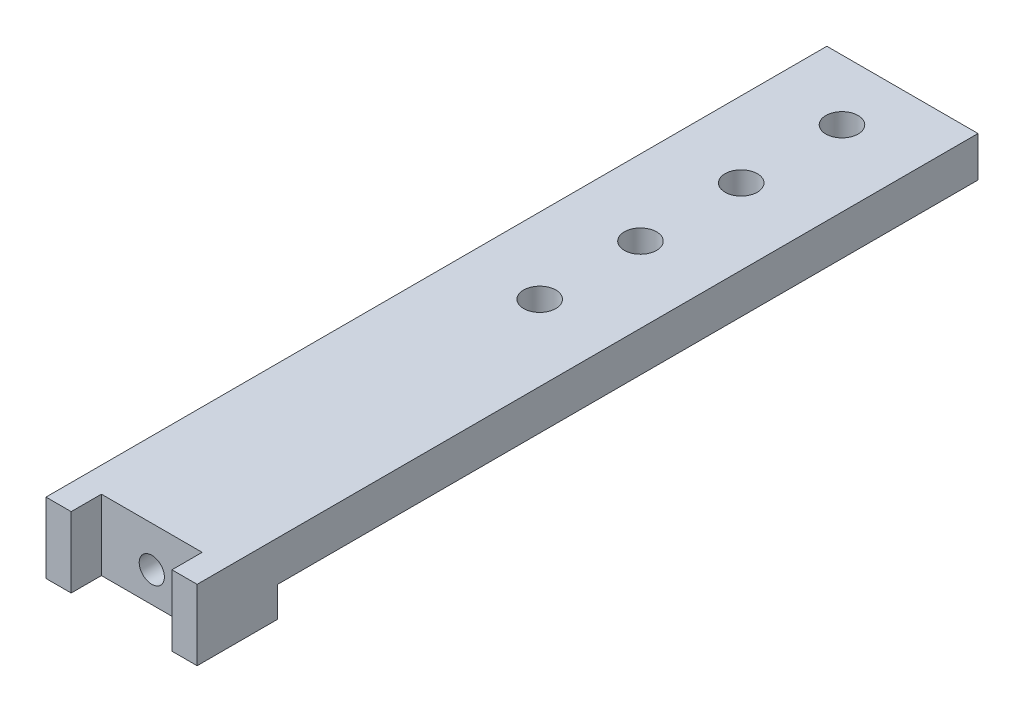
ISO-10303-21;
HEADER;
FILE_DESCRIPTION(('STEP AP214'),'2;1');
FILE_NAME('part.step','',(''),(''),'','','');
FILE_SCHEMA(('AUTOMOTIVE_DESIGN { 1 0 10303 214 1 1 1 1 }'));
ENDSEC;
DATA;
#1=APPLICATION_CONTEXT('core data for automotive mechanical design processes');
#2=APPLICATION_PROTOCOL_DEFINITION('international standard','automotive_design',2000,#1);
#3=PRODUCT_CONTEXT('',#1,'mechanical');
#4=PRODUCT('Part','Part','',(#3));
#5=PRODUCT_RELATED_PRODUCT_CATEGORY('part','',(#4));
#6=PRODUCT_DEFINITION_FORMATION('','',#4);
#7=PRODUCT_DEFINITION_CONTEXT('part definition',#1,'design');
#8=PRODUCT_DEFINITION('design','',#6,#7);
#9=PRODUCT_DEFINITION_SHAPE('','',#8);
#10=(LENGTH_UNIT() NAMED_UNIT(*) SI_UNIT(.MILLI.,.METRE.));
#11=(NAMED_UNIT(*) PLANE_ANGLE_UNIT() SI_UNIT($,.RADIAN.));
#12=(NAMED_UNIT(*) SI_UNIT($,.STERADIAN.) SOLID_ANGLE_UNIT());
#13=UNCERTAINTY_MEASURE_WITH_UNIT(LENGTH_MEASURE(1.E-05),#10,'distance_accuracy_value','');
#14=(GEOMETRIC_REPRESENTATION_CONTEXT(3) GLOBAL_UNCERTAINTY_ASSIGNED_CONTEXT((#13)) GLOBAL_UNIT_ASSIGNED_CONTEXT((#10,
#11,#12)) REPRESENTATION_CONTEXT('',''));
#15=CARTESIAN_POINT('',(0.,0.,0.));
#16=DIRECTION('',(0.,0.,1.));
#17=DIRECTION('',(1.,0.,0.));
#18=AXIS2_PLACEMENT_3D('',#15,#16,#17);
#19=CARTESIAN_POINT('',(-7.49999999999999,4.,37.25));
#20=DIRECTION('',(0.,0.,-1.));
#21=DIRECTION('',(-1.,0.,0.));
#22=AXIS2_PLACEMENT_3D('',#19,#20,#21);
#23=PLANE('',#22);
#24=CARTESIAN_POINT('',(0.,0.,37.25));
#25=DIRECTION('',(0.,0.,1.));
#26=DIRECTION('',(1.,0.,0.));
#27=AXIS2_PLACEMENT_3D('',#24,#25,#26);
#28=CIRCLE('',#27,1.25);
#29=CARTESIAN_POINT('',(1.25,0.,37.25));
#30=VERTEX_POINT('',#29);
#31=EDGE_CURVE('E146',#30,#30,#28,.T.);
#32=ORIENTED_EDGE('',*,*,#31,.F.);
#33=EDGE_LOOP('',(#32));
#34=FACE_BOUND('',#33,.T.);
#35=DIRECTION('',(0.,1.,0.));
#36=VECTOR('',#35,1.);
#37=CARTESIAN_POINT('',(-5.,-3.,37.25));
#38=LINE('',#37,#36);
#39=CARTESIAN_POINT('',(-5.,-3.,37.25));
#40=VERTEX_POINT('',#39);
#41=CARTESIAN_POINT('',(-5.,4.,37.25));
#42=VERTEX_POINT('',#41);
#43=EDGE_CURVE('E528',#40,#42,#38,.T.);
#44=ORIENTED_EDGE('',*,*,#43,.F.);
#45=DIRECTION('',(-1.,0.,0.));
#46=VECTOR('',#45,1.);
#47=CARTESIAN_POINT('',(7.50000000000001,-3.,37.25));
#48=LINE('',#47,#46);
#49=CARTESIAN_POINT('',(5.00000000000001,-3.,37.25));
#50=VERTEX_POINT('',#49);
#51=EDGE_CURVE('E168',#50,#40,#48,.T.);
#52=ORIENTED_EDGE('',*,*,#51,.F.);
#53=DIRECTION('',(0.,-1.,0.));
#54=VECTOR('',#53,1.);
#55=CARTESIAN_POINT('',(5.00000000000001,-3.,37.25));
#56=LINE('',#55,#54);
#57=CARTESIAN_POINT('',(5.00000000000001,4.,37.25));
#58=VERTEX_POINT('',#57);
#59=EDGE_CURVE('E274',#58,#50,#56,.T.);
#60=ORIENTED_EDGE('',*,*,#59,.F.);
#61=DIRECTION('',(1.,0.,0.));
#62=VECTOR('',#61,1.);
#63=CARTESIAN_POINT('',(-7.49999999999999,4.,37.25));
#64=LINE('',#63,#62);
#65=EDGE_CURVE('E56',#42,#58,#64,.T.);
#66=ORIENTED_EDGE('',*,*,#65,.F.);
#67=EDGE_LOOP('',(#44,#52,#60,#66));
#68=FACE_BOUND('',#67,.T.);
#69=ADVANCED_FACE('F34',(#34,#68),#23,.F.);
#70=CARTESIAN_POINT('',(0.,0.,0.));
#71=DIRECTION('',(0.,1.,0.));
#72=DIRECTION('',(0.,0.,1.));
#73=AXIS2_PLACEMENT_3D('',#70,#71,#72);
#74=PLANE('',#73);
#75=DIRECTION('',(1.,0.,0.));
#76=VECTOR('',#75,1.);
#77=CARTESIAN_POINT('',(7.50000000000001,0.,32.25));
#78=LINE('',#77,#76);
#79=CARTESIAN_POINT('',(-7.49999999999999,0.,32.25));
#80=VERTEX_POINT('',#79);
#81=CARTESIAN_POINT('',(-1.25,0.,32.25));
#82=VERTEX_POINT('',#81);
#83=EDGE_CURVE('E157',#80,#82,#78,.T.);
#84=ORIENTED_EDGE('',*,*,#83,.F.);
#85=DIRECTION('',(0.,0.,1.));
#86=VECTOR('',#85,1.);
#87=CARTESIAN_POINT('',(-7.5,0.,-37.25));
#88=LINE('',#87,#86);
#89=CARTESIAN_POINT('',(-7.5,0.,-37.25));
#90=VERTEX_POINT('',#89);
#91=EDGE_CURVE('E231',#90,#80,#88,.T.);
#92=ORIENTED_EDGE('',*,*,#91,.F.);
#93=DIRECTION('',(-1.,0.,0.));
#94=VECTOR('',#93,1.);
#95=CARTESIAN_POINT('',(-7.5,0.,-37.25));
#96=LINE('',#95,#94);
#97=CARTESIAN_POINT('',(-5.,0.,-37.25));
#98=VERTEX_POINT('',#97);
#99=EDGE_CURVE('E237',#98,#90,#96,.T.);
#100=ORIENTED_EDGE('',*,*,#99,.F.);
#101=DIRECTION('',(0.,0.,1.));
#102=VECTOR('',#101,1.);
#103=CARTESIAN_POINT('',(-5.,0.,-37.25));
#104=LINE('',#103,#102);
#105=CARTESIAN_POINT('',(-5.,0.,2.75000000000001));
#106=VERTEX_POINT('',#105);
#107=EDGE_CURVE('E213',#98,#106,#104,.T.);
#108=ORIENTED_EDGE('',*,*,#107,.T.);
#109=DIRECTION('',(1.,0.,0.));
#110=VECTOR('',#109,1.);
#111=CARTESIAN_POINT('',(-5.,0.,2.75000000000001));
#112=LINE('',#111,#110);
#113=CARTESIAN_POINT('',(5.,0.,2.75000000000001));
#114=VERTEX_POINT('',#113);
#115=EDGE_CURVE('E201',#106,#114,#112,.T.);
#116=ORIENTED_EDGE('',*,*,#115,.T.);
#117=DIRECTION('',(0.,0.,-1.));
#118=VECTOR('',#117,1.);
#119=CARTESIAN_POINT('',(5.,0.,-37.25));
#120=LINE('',#119,#118);
#121=CARTESIAN_POINT('',(5.,0.,-37.25));
#122=VERTEX_POINT('',#121);
#123=EDGE_CURVE('E194',#114,#122,#120,.T.);
#124=ORIENTED_EDGE('',*,*,#123,.T.);
#125=CARTESIAN_POINT('',(7.5,0.,-37.25));
#126=VERTEX_POINT('',#125);
#127=EDGE_CURVE('E238',#126,#122,#96,.T.);
#128=ORIENTED_EDGE('',*,*,#127,.F.);
#129=DIRECTION('',(0.,0.,-1.));
#130=VECTOR('',#129,1.);
#131=CARTESIAN_POINT('',(7.5,0.,-37.25));
#132=LINE('',#131,#130);
#133=CARTESIAN_POINT('',(7.50000000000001,0.,32.25));
#134=VERTEX_POINT('',#133);
#135=EDGE_CURVE('E221',#134,#126,#132,.T.);
#136=ORIENTED_EDGE('',*,*,#135,.F.);
#137=CARTESIAN_POINT('',(1.25,0.,32.25));
#138=VERTEX_POINT('',#137);
#139=EDGE_CURVE('E160',#138,#134,#78,.T.);
#140=ORIENTED_EDGE('',*,*,#139,.F.);
#141=EDGE_CURVE('E143',#82,#138,#78,.T.);
#142=ORIENTED_EDGE('',*,*,#141,.F.);
#143=EDGE_LOOP('',(#84,#92,#100,#108,#116,#124,#128,#136,#140,#142));
#144=FACE_BOUND('',#143,.T.);
#145=ADVANCED_FACE('F155',(#144),#74,.F.);
#146=CARTESIAN_POINT('',(7.5,4.,-37.25));
#147=DIRECTION('',(-1.,0.,0.));
#148=DIRECTION('',(0.,0.,1.));
#149=AXIS2_PLACEMENT_3D('',#146,#147,#148);
#150=PLANE('',#149);
#151=DIRECTION('',(0.,0.,-1.));
#152=VECTOR('',#151,1.);
#153=CARTESIAN_POINT('',(7.5,4.,-37.25));
#154=LINE('',#153,#152);
#155=CARTESIAN_POINT('',(7.50000000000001,4.,40.25));
#156=VERTEX_POINT('',#155);
#157=CARTESIAN_POINT('',(7.5,4.,-37.25));
#158=VERTEX_POINT('',#157);
#159=EDGE_CURVE('E227',#156,#158,#154,.T.);
#160=ORIENTED_EDGE('',*,*,#159,.F.);
#161=DIRECTION('',(0.,1.,0.));
#162=VECTOR('',#161,1.);
#163=CARTESIAN_POINT('',(7.50000000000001,-3.,40.25));
#164=LINE('',#163,#162);
#165=CARTESIAN_POINT('',(7.50000000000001,-3.,40.25));
#166=VERTEX_POINT('',#165);
#167=EDGE_CURVE('E265',#166,#156,#164,.T.);
#168=ORIENTED_EDGE('',*,*,#167,.F.);
#169=DIRECTION('',(0.,0.,1.));
#170=VECTOR('',#169,1.);
#171=CARTESIAN_POINT('',(7.50000000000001,-3.,37.25));
#172=LINE('',#171,#170);
#173=CARTESIAN_POINT('',(7.50000000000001,-3.,32.25));
#174=VERTEX_POINT('',#173);
#175=EDGE_CURVE('E167',#174,#166,#172,.T.);
#176=ORIENTED_EDGE('',*,*,#175,.F.);
#177=DIRECTION('',(0.,1.,0.));
#178=VECTOR('',#177,1.);
#179=CARTESIAN_POINT('',(7.50000000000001,-3.,32.25));
#180=LINE('',#179,#178);
#181=EDGE_CURVE('E189',#174,#134,#180,.T.);
#182=ORIENTED_EDGE('',*,*,#181,.T.);
#183=ORIENTED_EDGE('',*,*,#135,.T.);
#184=DIRECTION('',(0.,-1.,0.));
#185=VECTOR('',#184,1.);
#186=CARTESIAN_POINT('',(7.5,4.,-37.25));
#187=LINE('',#186,#185);
#188=EDGE_CURVE('E11',#158,#126,#187,.T.);
#189=ORIENTED_EDGE('',*,*,#188,.F.);
#190=EDGE_LOOP('',(#160,#168,#176,#182,#183,#189));
#191=FACE_BOUND('',#190,.T.);
#192=ADVANCED_FACE('F36',(#191),#150,.F.);
#193=CARTESIAN_POINT('',(-7.5,4.,-37.25));
#194=DIRECTION('',(0.,0.,1.));
#195=DIRECTION('',(1.,0.,0.));
#196=AXIS2_PLACEMENT_3D('',#193,#194,#195);
#197=PLANE('',#196);
#198=ORIENTED_EDGE('',*,*,#127,.T.);
#199=DIRECTION('',(0.,1.,0.));
#200=VECTOR('',#199,1.);
#201=CARTESIAN_POINT('',(5.,-1.,-37.25));
#202=LINE('',#201,#200);
#203=CARTESIAN_POINT('',(5.,-1.,-37.25));
#204=VERTEX_POINT('',#203);
#205=EDGE_CURVE('E210',#204,#122,#202,.T.);
#206=ORIENTED_EDGE('',*,*,#205,.F.);
#207=DIRECTION('',(-1.,0.,0.));
#208=VECTOR('',#207,1.);
#209=CARTESIAN_POINT('',(-5.,-1.,-37.25));
#210=LINE('',#209,#208);
#211=CARTESIAN_POINT('',(-5.,-1.,-37.25));
#212=VERTEX_POINT('',#211);
#213=EDGE_CURVE('E200',#204,#212,#210,.T.);
#214=ORIENTED_EDGE('',*,*,#213,.T.);
#215=DIRECTION('',(0.,1.,0.));
#216=VECTOR('',#215,1.);
#217=CARTESIAN_POINT('',(-5.,-1.,-37.25));
#218=LINE('',#217,#216);
#219=EDGE_CURVE('E224',#212,#98,#218,.T.);
#220=ORIENTED_EDGE('',*,*,#219,.T.);
#221=ORIENTED_EDGE('',*,*,#99,.T.);
#222=DIRECTION('',(0.,-1.,0.));
#223=VECTOR('',#222,1.);
#224=CARTESIAN_POINT('',(-7.5,4.,-37.25));
#225=LINE('',#224,#223);
#226=CARTESIAN_POINT('',(-7.5,4.,-37.25));
#227=VERTEX_POINT('',#226);
#228=EDGE_CURVE('E42',#227,#90,#225,.T.);
#229=ORIENTED_EDGE('',*,*,#228,.F.);
#230=DIRECTION('',(-1.,0.,0.));
#231=VECTOR('',#230,1.);
#232=CARTESIAN_POINT('',(-7.5,4.,-37.25));
#233=LINE('',#232,#231);
#234=EDGE_CURVE('E230',#158,#227,#233,.T.);
#235=ORIENTED_EDGE('',*,*,#234,.F.);
#236=ORIENTED_EDGE('',*,*,#188,.T.);
#237=EDGE_LOOP('',(#198,#206,#214,#220,#221,#229,#235,#236));
#238=FACE_BOUND('',#237,.T.);
#239=ADVANCED_FACE('F250',(#238),#197,.F.);
#240=CARTESIAN_POINT('',(-7.5,4.,-37.25));
#241=DIRECTION('',(1.,0.,0.));
#242=DIRECTION('',(0.,0.,-1.));
#243=AXIS2_PLACEMENT_3D('',#240,#241,#242);
#244=PLANE('',#243);
#245=ORIENTED_EDGE('',*,*,#91,.T.);
#246=DIRECTION('',(0.,1.,0.));
#247=VECTOR('',#246,1.);
#248=CARTESIAN_POINT('',(-7.5,-3.,32.25));
#249=LINE('',#248,#247);
#250=CARTESIAN_POINT('',(-7.5,-3.,32.25));
#251=VERTEX_POINT('',#250);
#252=EDGE_CURVE('E166',#251,#80,#249,.T.);
#253=ORIENTED_EDGE('',*,*,#252,.F.);
#254=DIRECTION('',(0.,0.,-1.));
#255=VECTOR('',#254,1.);
#256=CARTESIAN_POINT('',(-7.49999999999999,-3.,37.25));
#257=LINE('',#256,#255);
#258=CARTESIAN_POINT('',(-7.49999999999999,-3.,40.25));
#259=VERTEX_POINT('',#258);
#260=EDGE_CURVE('E187',#259,#251,#257,.T.);
#261=ORIENTED_EDGE('',*,*,#260,.F.);
#262=DIRECTION('',(0.,-1.,0.));
#263=VECTOR('',#262,1.);
#264=CARTESIAN_POINT('',(-7.49999999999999,-3.,40.25));
#265=LINE('',#264,#263);
#266=CARTESIAN_POINT('',(-7.49999999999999,4.,40.25));
#267=VERTEX_POINT('',#266);
#268=EDGE_CURVE('E534',#267,#259,#265,.T.);
#269=ORIENTED_EDGE('',*,*,#268,.F.);
#270=DIRECTION('',(0.,0.,1.));
#271=VECTOR('',#270,1.);
#272=CARTESIAN_POINT('',(-7.5,4.,-37.25));
#273=LINE('',#272,#271);
#274=EDGE_CURVE('E233',#227,#267,#273,.T.);
#275=ORIENTED_EDGE('',*,*,#274,.F.);
#276=ORIENTED_EDGE('',*,*,#228,.T.);
#277=EDGE_LOOP('',(#245,#253,#261,#269,#275,#276));
#278=FACE_BOUND('',#277,.T.);
#279=ADVANCED_FACE('F245',(#278),#244,.F.);
#280=CARTESIAN_POINT('',(0.,4.,0.));
#281=DIRECTION('',(0.,1.,0.));
#282=DIRECTION('',(0.,0.,1.));
#283=AXIS2_PLACEMENT_3D('',#280,#281,#282);
#284=PLANE('',#283);
#285=CARTESIAN_POINT('',(0.,4.,-21.25));
#286=DIRECTION('',(0.,-1.,0.));
#287=DIRECTION('',(0.,0.,-1.));
#288=AXIS2_PLACEMENT_3D('',#285,#286,#287);
#289=CIRCLE('',#288,1.6);
#290=CARTESIAN_POINT('',(0.,4.,-22.85));
#291=VERTEX_POINT('',#290);
#292=EDGE_CURVE('E525',#291,#291,#289,.T.);
#293=ORIENTED_EDGE('',*,*,#292,.T.);
#294=EDGE_LOOP('',(#293));
#295=FACE_BOUND('',#294,.T.);
#296=CARTESIAN_POINT('',(0.,4.,-11.25));
#297=DIRECTION('',(0.,-1.,0.));
#298=DIRECTION('',(0.,0.,-1.));
#299=AXIS2_PLACEMENT_3D('',#296,#297,#298);
#300=CIRCLE('',#299,1.6);
#301=CARTESIAN_POINT('',(0.,4.,-12.85));
#302=VERTEX_POINT('',#301);
#303=EDGE_CURVE('E556',#302,#302,#300,.T.);
#304=ORIENTED_EDGE('',*,*,#303,.T.);
#305=EDGE_LOOP('',(#304));
#306=FACE_BOUND('',#305,.T.);
#307=CARTESIAN_POINT('',(0.,4.,-1.24999999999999));
#308=DIRECTION('',(0.,-1.,0.));
#309=DIRECTION('',(0.,0.,-1.));
#310=AXIS2_PLACEMENT_3D('',#307,#308,#309);
#311=CIRCLE('',#310,1.6);
#312=CARTESIAN_POINT('',(0.,4.,-2.84999999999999));
#313=VERTEX_POINT('',#312);
#314=EDGE_CURVE('E552',#313,#313,#311,.T.);
#315=ORIENTED_EDGE('',*,*,#314,.T.);
#316=EDGE_LOOP('',(#315));
#317=FACE_BOUND('',#316,.T.);
#318=CARTESIAN_POINT('',(0.,4.,-31.25));
#319=DIRECTION('',(0.,-1.,0.));
#320=DIRECTION('',(0.,0.,-1.));
#321=AXIS2_PLACEMENT_3D('',#318,#319,#320);
#322=CIRCLE('',#321,1.6);
#323=CARTESIAN_POINT('',(0.,4.,-32.85));
#324=VERTEX_POINT('',#323);
#325=EDGE_CURVE('E524',#324,#324,#322,.T.);
#326=ORIENTED_EDGE('',*,*,#325,.T.);
#327=EDGE_LOOP('',(#326));
#328=FACE_BOUND('',#327,.T.);
#329=ORIENTED_EDGE('',*,*,#159,.T.);
#330=ORIENTED_EDGE('',*,*,#234,.T.);
#331=ORIENTED_EDGE('',*,*,#274,.T.);
#332=DIRECTION('',(-1.,0.,0.));
#333=VECTOR('',#332,1.);
#334=CARTESIAN_POINT('',(-7.49999999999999,4.,40.25));
#335=LINE('',#334,#333);
#336=CARTESIAN_POINT('',(-5.,4.,40.25));
#337=VERTEX_POINT('',#336);
#338=EDGE_CURVE('E541',#337,#267,#335,.T.);
#339=ORIENTED_EDGE('',*,*,#338,.F.);
#340=DIRECTION('',(0.,0.,-1.));
#341=VECTOR('',#340,1.);
#342=CARTESIAN_POINT('',(-5.,4.,40.25));
#343=LINE('',#342,#341);
#344=EDGE_CURVE('E544',#337,#42,#343,.T.);
#345=ORIENTED_EDGE('',*,*,#344,.T.);
#346=ORIENTED_EDGE('',*,*,#65,.T.);
#347=DIRECTION('',(0.,0.,-1.));
#348=VECTOR('',#347,1.);
#349=CARTESIAN_POINT('',(5.00000000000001,4.,40.25));
#350=LINE('',#349,#348);
#351=CARTESIAN_POINT('',(5.00000000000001,4.,40.25));
#352=VERTEX_POINT('',#351);
#353=EDGE_CURVE('E172',#352,#58,#350,.T.);
#354=ORIENTED_EDGE('',*,*,#353,.F.);
#355=DIRECTION('',(-1.,0.,0.));
#356=VECTOR('',#355,1.);
#357=CARTESIAN_POINT('',(7.50000000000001,4.,40.25));
#358=LINE('',#357,#356);
#359=EDGE_CURVE('E266',#156,#352,#358,.T.);
#360=ORIENTED_EDGE('',*,*,#359,.F.);
#361=EDGE_LOOP('',(#329,#330,#331,#339,#345,#346,#354,#360));
#362=FACE_BOUND('',#361,.T.);
#363=ADVANCED_FACE('F267',(#295,#306,#317,#328,#362),#284,.T.);
#364=CARTESIAN_POINT('',(5.,-1.,-37.25));
#365=DIRECTION('',(1.,0.,0.));
#366=DIRECTION('',(0.,0.,-1.));
#367=AXIS2_PLACEMENT_3D('',#364,#365,#366);
#368=PLANE('',#367);
#369=ORIENTED_EDGE('',*,*,#123,.F.);
#370=DIRECTION('',(0.,1.,0.));
#371=VECTOR('',#370,1.);
#372=CARTESIAN_POINT('',(5.,-1.,2.75000000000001));
#373=LINE('',#372,#371);
#374=CARTESIAN_POINT('',(5.,-1.,2.75000000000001));
#375=VERTEX_POINT('',#374);
#376=EDGE_CURVE('E218',#375,#114,#373,.T.);
#377=ORIENTED_EDGE('',*,*,#376,.F.);
#378=DIRECTION('',(0.,0.,-1.));
#379=VECTOR('',#378,1.);
#380=CARTESIAN_POINT('',(5.,-1.,-37.25));
#381=LINE('',#380,#379);
#382=EDGE_CURVE('E197',#375,#204,#381,.T.);
#383=ORIENTED_EDGE('',*,*,#382,.T.);
#384=ORIENTED_EDGE('',*,*,#205,.T.);
#385=EDGE_LOOP('',(#369,#377,#383,#384));
#386=FACE_BOUND('',#385,.T.);
#387=ADVANCED_FACE('F443',(#386),#368,.T.);
#388=CARTESIAN_POINT('',(-5.,-1.,2.75000000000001));
#389=DIRECTION('',(0.,0.,1.));
#390=DIRECTION('',(1.,0.,0.));
#391=AXIS2_PLACEMENT_3D('',#388,#389,#390);
#392=PLANE('',#391);
#393=ORIENTED_EDGE('',*,*,#115,.F.);
#394=DIRECTION('',(0.,1.,0.));
#395=VECTOR('',#394,1.);
#396=CARTESIAN_POINT('',(-5.,-1.,2.75000000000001));
#397=LINE('',#396,#395);
#398=CARTESIAN_POINT('',(-5.,-1.,2.75000000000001));
#399=VERTEX_POINT('',#398);
#400=EDGE_CURVE('E222',#399,#106,#397,.T.);
#401=ORIENTED_EDGE('',*,*,#400,.F.);
#402=DIRECTION('',(1.,0.,0.));
#403=VECTOR('',#402,1.);
#404=CARTESIAN_POINT('',(-5.,-1.,2.75000000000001));
#405=LINE('',#404,#403);
#406=EDGE_CURVE('E207',#399,#375,#405,.T.);
#407=ORIENTED_EDGE('',*,*,#406,.T.);
#408=ORIENTED_EDGE('',*,*,#376,.T.);
#409=EDGE_LOOP('',(#393,#401,#407,#408));
#410=FACE_BOUND('',#409,.T.);
#411=ADVANCED_FACE('F258',(#410),#392,.T.);
#412=CARTESIAN_POINT('',(-5.,-1.,-37.25));
#413=DIRECTION('',(-1.,0.,0.));
#414=DIRECTION('',(0.,0.,1.));
#415=AXIS2_PLACEMENT_3D('',#412,#413,#414);
#416=PLANE('',#415);
#417=ORIENTED_EDGE('',*,*,#107,.F.);
#418=ORIENTED_EDGE('',*,*,#219,.F.);
#419=DIRECTION('',(0.,0.,1.));
#420=VECTOR('',#419,1.);
#421=CARTESIAN_POINT('',(-5.,-1.,-37.25));
#422=LINE('',#421,#420);
#423=EDGE_CURVE('E204',#212,#399,#422,.T.);
#424=ORIENTED_EDGE('',*,*,#423,.T.);
#425=ORIENTED_EDGE('',*,*,#400,.T.);
#426=EDGE_LOOP('',(#417,#418,#424,#425));
#427=FACE_BOUND('',#426,.T.);
#428=ADVANCED_FACE('F254',(#427),#416,.T.);
#429=CARTESIAN_POINT('',(0.,-1.,0.));
#430=DIRECTION('',(0.,1.,0.));
#431=DIRECTION('',(0.,0.,1.));
#432=AXIS2_PLACEMENT_3D('',#429,#430,#431);
#433=PLANE('',#432);
#434=CARTESIAN_POINT('',(0.,-1.,-21.25));
#435=DIRECTION('',(0.,-1.,0.));
#436=DIRECTION('',(0.,0.,-1.));
#437=AXIS2_PLACEMENT_3D('',#434,#435,#436);
#438=CIRCLE('',#437,1.6);
#439=CARTESIAN_POINT('',(0.,-1.,-22.85));
#440=VERTEX_POINT('',#439);
#441=EDGE_CURVE('E510',#440,#440,#438,.T.);
#442=ORIENTED_EDGE('',*,*,#441,.F.);
#443=EDGE_LOOP('',(#442));
#444=FACE_BOUND('',#443,.T.);
#445=CARTESIAN_POINT('',(0.,-1.,-11.25));
#446=DIRECTION('',(0.,-1.,0.));
#447=DIRECTION('',(0.,0.,-1.));
#448=AXIS2_PLACEMENT_3D('',#445,#446,#447);
#449=CIRCLE('',#448,1.6);
#450=CARTESIAN_POINT('',(0.,-1.,-12.85));
#451=VERTEX_POINT('',#450);
#452=EDGE_CURVE('E514',#451,#451,#449,.T.);
#453=ORIENTED_EDGE('',*,*,#452,.F.);
#454=EDGE_LOOP('',(#453));
#455=FACE_BOUND('',#454,.T.);
#456=CARTESIAN_POINT('',(0.,-1.,-1.24999999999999));
#457=DIRECTION('',(0.,-1.,0.));
#458=DIRECTION('',(0.,0.,-1.));
#459=AXIS2_PLACEMENT_3D('',#456,#457,#458);
#460=CIRCLE('',#459,1.6);
#461=CARTESIAN_POINT('',(0.,-1.,-2.84999999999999));
#462=VERTEX_POINT('',#461);
#463=EDGE_CURVE('E153',#462,#462,#460,.T.);
#464=ORIENTED_EDGE('',*,*,#463,.F.);
#465=EDGE_LOOP('',(#464));
#466=FACE_BOUND('',#465,.T.);
#467=CARTESIAN_POINT('',(0.,-1.,-31.25));
#468=DIRECTION('',(0.,-1.,0.));
#469=DIRECTION('',(0.,0.,-1.));
#470=AXIS2_PLACEMENT_3D('',#467,#468,#469);
#471=CIRCLE('',#470,1.6);
#472=CARTESIAN_POINT('',(0.,-1.,-32.85));
#473=VERTEX_POINT('',#472);
#474=EDGE_CURVE('E521',#473,#473,#471,.T.);
#475=ORIENTED_EDGE('',*,*,#474,.F.);
#476=EDGE_LOOP('',(#475));
#477=FACE_BOUND('',#476,.T.);
#478=ORIENTED_EDGE('',*,*,#382,.F.);
#479=ORIENTED_EDGE('',*,*,#406,.F.);
#480=ORIENTED_EDGE('',*,*,#423,.F.);
#481=ORIENTED_EDGE('',*,*,#213,.F.);
#482=EDGE_LOOP('',(#478,#479,#480,#481));
#483=FACE_BOUND('',#482,.T.);
#484=ADVANCED_FACE('F291',(#444,#455,#466,#477,#483),#433,.F.);
#485=CARTESIAN_POINT('',(7.50000000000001,-3.,32.25));
#486=DIRECTION('',(0.,0.,1.));
#487=DIRECTION('',(1.,0.,0.));
#488=AXIS2_PLACEMENT_3D('',#485,#486,#487);
#489=PLANE('',#488);
#490=ORIENTED_EDGE('',*,*,#83,.T.);
#491=CARTESIAN_POINT('',(0.,0.,32.25));
#492=DIRECTION('',(0.,0.,1.));
#493=DIRECTION('',(1.,0.,0.));
#494=AXIS2_PLACEMENT_3D('',#491,#492,#493);
#495=CIRCLE('',#494,1.25);
#496=EDGE_CURVE('E145',#138,#82,#495,.F.);
#497=ORIENTED_EDGE('',*,*,#496,.F.);
#498=ORIENTED_EDGE('',*,*,#139,.T.);
#499=ORIENTED_EDGE('',*,*,#181,.F.);
#500=DIRECTION('',(1.,0.,0.));
#501=VECTOR('',#500,1.);
#502=CARTESIAN_POINT('',(7.50000000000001,-3.,32.25));
#503=LINE('',#502,#501);
#504=EDGE_CURVE('E188',#251,#174,#503,.T.);
#505=ORIENTED_EDGE('',*,*,#504,.F.);
#506=ORIENTED_EDGE('',*,*,#252,.T.);
#507=EDGE_LOOP('',(#490,#497,#498,#499,#505,#506));
#508=FACE_BOUND('',#507,.T.);
#509=ADVANCED_FACE('F163',(#508),#489,.F.);
#510=CARTESIAN_POINT('',(0.,-3.,0.));
#511=DIRECTION('',(0.,1.,0.));
#512=DIRECTION('',(0.,0.,1.));
#513=AXIS2_PLACEMENT_3D('',#510,#511,#512);
#514=PLANE('',#513);
#515=ORIENTED_EDGE('',*,*,#175,.T.);
#516=DIRECTION('',(1.,0.,0.));
#517=VECTOR('',#516,1.);
#518=CARTESIAN_POINT('',(7.50000000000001,-3.,40.25));
#519=LINE('',#518,#517);
#520=CARTESIAN_POINT('',(5.00000000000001,-3.,40.25));
#521=VERTEX_POINT('',#520);
#522=EDGE_CURVE('E181',#521,#166,#519,.T.);
#523=ORIENTED_EDGE('',*,*,#522,.F.);
#524=DIRECTION('',(0.,0.,-1.));
#525=VECTOR('',#524,1.);
#526=CARTESIAN_POINT('',(5.00000000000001,-3.,40.25));
#527=LINE('',#526,#525);
#528=EDGE_CURVE('E175',#521,#50,#527,.T.);
#529=ORIENTED_EDGE('',*,*,#528,.T.);
#530=ORIENTED_EDGE('',*,*,#51,.T.);
#531=DIRECTION('',(0.,0.,-1.));
#532=VECTOR('',#531,1.);
#533=CARTESIAN_POINT('',(-5.,-3.,40.25));
#534=LINE('',#533,#532);
#535=CARTESIAN_POINT('',(-5.,-3.,40.25));
#536=VERTEX_POINT('',#535);
#537=EDGE_CURVE('E276',#536,#40,#534,.T.);
#538=ORIENTED_EDGE('',*,*,#537,.F.);
#539=DIRECTION('',(1.,0.,0.));
#540=VECTOR('',#539,1.);
#541=CARTESIAN_POINT('',(-7.49999999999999,-3.,40.25));
#542=LINE('',#541,#540);
#543=EDGE_CURVE('E537',#259,#536,#542,.T.);
#544=ORIENTED_EDGE('',*,*,#543,.F.);
#545=ORIENTED_EDGE('',*,*,#260,.T.);
#546=ORIENTED_EDGE('',*,*,#504,.T.);
#547=EDGE_LOOP('',(#515,#523,#529,#530,#538,#544,#545,#546));
#548=FACE_BOUND('',#547,.T.);
#549=ADVANCED_FACE('F283',(#548),#514,.F.);
#550=CARTESIAN_POINT('',(5.00000000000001,-3.,40.25));
#551=DIRECTION('',(1.,0.,0.));
#552=DIRECTION('',(0.,1.,0.));
#553=AXIS2_PLACEMENT_3D('',#550,#551,#552);
#554=PLANE('',#553);
#555=ORIENTED_EDGE('',*,*,#59,.T.);
#556=ORIENTED_EDGE('',*,*,#528,.F.);
#557=DIRECTION('',(0.,-1.,0.));
#558=VECTOR('',#557,1.);
#559=CARTESIAN_POINT('',(5.00000000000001,-3.,40.25));
#560=LINE('',#559,#558);
#561=EDGE_CURVE('E269',#352,#521,#560,.T.);
#562=ORIENTED_EDGE('',*,*,#561,.F.);
#563=ORIENTED_EDGE('',*,*,#353,.T.);
#564=EDGE_LOOP('',(#555,#556,#562,#563));
#565=FACE_BOUND('',#564,.T.);
#566=ADVANCED_FACE('F282',(#565),#554,.F.);
#567=CARTESIAN_POINT('',(0.,0.,40.25));
#568=DIRECTION('',(0.,0.,1.));
#569=DIRECTION('',(1.,0.,0.));
#570=AXIS2_PLACEMENT_3D('',#567,#568,#569);
#571=PLANE('',#570);
#572=ORIENTED_EDGE('',*,*,#167,.T.);
#573=ORIENTED_EDGE('',*,*,#359,.T.);
#574=ORIENTED_EDGE('',*,*,#561,.T.);
#575=ORIENTED_EDGE('',*,*,#522,.T.);
#576=EDGE_LOOP('',(#572,#573,#574,#575));
#577=FACE_BOUND('',#576,.T.);
#578=ADVANCED_FACE('F272',(#577),#571,.T.);
#579=CARTESIAN_POINT('',(-5.,-3.,40.25));
#580=DIRECTION('',(-1.,0.,0.));
#581=DIRECTION('',(0.,0.,1.));
#582=AXIS2_PLACEMENT_3D('',#579,#580,#581);
#583=PLANE('',#582);
#584=ORIENTED_EDGE('',*,*,#43,.T.);
#585=ORIENTED_EDGE('',*,*,#344,.F.);
#586=DIRECTION('',(0.,1.,0.));
#587=VECTOR('',#586,1.);
#588=CARTESIAN_POINT('',(-5.,-3.,40.25));
#589=LINE('',#588,#587);
#590=EDGE_CURVE('E539',#536,#337,#589,.T.);
#591=ORIENTED_EDGE('',*,*,#590,.F.);
#592=ORIENTED_EDGE('',*,*,#537,.T.);
#593=EDGE_LOOP('',(#584,#585,#591,#592));
#594=FACE_BOUND('',#593,.T.);
#595=ADVANCED_FACE('F372',(#594),#583,.F.);
#596=CARTESIAN_POINT('',(0.,0.,40.25));
#597=DIRECTION('',(0.,0.,-1.));
#598=DIRECTION('',(-1.,0.,0.));
#599=AXIS2_PLACEMENT_3D('',#596,#597,#598);
#600=PLANE('',#599);
#601=ORIENTED_EDGE('',*,*,#268,.T.);
#602=ORIENTED_EDGE('',*,*,#543,.T.);
#603=ORIENTED_EDGE('',*,*,#590,.T.);
#604=ORIENTED_EDGE('',*,*,#338,.T.);
#605=EDGE_LOOP('',(#601,#602,#603,#604));
#606=FACE_BOUND('',#605,.T.);
#607=ADVANCED_FACE('F368',(#606),#600,.F.);
#608=CARTESIAN_POINT('',(0.,4.,-31.25));
#609=DIRECTION('',(0.,-1.,0.));
#610=DIRECTION('',(0.,0.,-1.));
#611=AXIS2_PLACEMENT_3D('',#608,#609,#610);
#612=CYLINDRICAL_SURFACE('',#611,1.6);
#613=ORIENTED_EDGE('',*,*,#325,.F.);
#614=EDGE_LOOP('',(#613));
#615=FACE_BOUND('',#614,.T.);
#616=ORIENTED_EDGE('',*,*,#474,.T.);
#617=EDGE_LOOP('',(#616));
#618=FACE_BOUND('',#617,.T.);
#619=ADVANCED_FACE('F364',(#615,#618),#612,.F.);
#620=CARTESIAN_POINT('',(0.,4.,-1.24999999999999));
#621=DIRECTION('',(0.,-1.,0.));
#622=DIRECTION('',(0.,0.,-1.));
#623=AXIS2_PLACEMENT_3D('',#620,#621,#622);
#624=CYLINDRICAL_SURFACE('',#623,1.6);
#625=ORIENTED_EDGE('',*,*,#314,.F.);
#626=EDGE_LOOP('',(#625));
#627=FACE_BOUND('',#626,.T.);
#628=ORIENTED_EDGE('',*,*,#463,.T.);
#629=EDGE_LOOP('',(#628));
#630=FACE_BOUND('',#629,.T.);
#631=ADVANCED_FACE('F360',(#627,#630),#624,.F.);
#632=CARTESIAN_POINT('',(0.,4.,-11.25));
#633=DIRECTION('',(0.,-1.,0.));
#634=DIRECTION('',(0.,0.,-1.));
#635=AXIS2_PLACEMENT_3D('',#632,#633,#634);
#636=CYLINDRICAL_SURFACE('',#635,1.6);
#637=ORIENTED_EDGE('',*,*,#303,.F.);
#638=EDGE_LOOP('',(#637));
#639=FACE_BOUND('',#638,.T.);
#640=ORIENTED_EDGE('',*,*,#452,.T.);
#641=EDGE_LOOP('',(#640));
#642=FACE_BOUND('',#641,.T.);
#643=ADVANCED_FACE('F356',(#639,#642),#636,.F.);
#644=CARTESIAN_POINT('',(0.,4.,-21.25));
#645=DIRECTION('',(0.,-1.,0.));
#646=DIRECTION('',(0.,0.,-1.));
#647=AXIS2_PLACEMENT_3D('',#644,#645,#646);
#648=CYLINDRICAL_SURFACE('',#647,1.6);
#649=ORIENTED_EDGE('',*,*,#292,.F.);
#650=EDGE_LOOP('',(#649));
#651=FACE_BOUND('',#650,.T.);
#652=ORIENTED_EDGE('',*,*,#441,.T.);
#653=EDGE_LOOP('',(#652));
#654=FACE_BOUND('',#653,.T.);
#655=ADVANCED_FACE('F340',(#651,#654),#648,.F.);
#656=CARTESIAN_POINT('',(7.50000000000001,-3.,32.25));
#657=DIRECTION('',(0.,0.,1.));
#658=DIRECTION('',(1.,0.,0.));
#659=AXIS2_PLACEMENT_3D('',#656,#657,#658);
#660=PLANE('',#659);
#661=ORIENTED_EDGE('',*,*,#141,.T.);
#662=EDGE_CURVE('E48',#82,#138,#495,.F.);
#663=ORIENTED_EDGE('',*,*,#662,.F.);
#664=EDGE_LOOP('',(#661,#663));
#665=FACE_BOUND('',#664,.T.);
#666=ADVANCED_FACE('F141',(#665),#660,.T.);
#667=CARTESIAN_POINT('',(0.,0.,28.7144660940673));
#668=DIRECTION('',(0.,0.,1.));
#669=DIRECTION('',(1.,0.,0.));
#670=AXIS2_PLACEMENT_3D('',#667,#668,#669);
#671=CYLINDRICAL_SURFACE('',#670,1.25);
#672=ORIENTED_EDGE('',*,*,#496,.T.);
#673=ORIENTED_EDGE('',*,*,#662,.T.);
#674=EDGE_LOOP('',(#672,#673));
#675=FACE_BOUND('',#674,.T.);
#676=ORIENTED_EDGE('',*,*,#31,.T.);
#677=EDGE_LOOP('',(#676));
#678=FACE_BOUND('',#677,.T.);
#679=ADVANCED_FACE('F148',(#675,#678),#671,.F.);
#680=CLOSED_SHELL('',(#69,#145,#192,#239,#279,#363,#387,#411,#428,#484,#509,#549,#566,#578,#595,
#607,#619,#631,#643,#655,#666,#679));
#681=MANIFOLD_SOLID_BREP('B2',#680);
#682=ADVANCED_BREP_SHAPE_REPRESENTATION('',(#18,#681),#14);
#683=SHAPE_DEFINITION_REPRESENTATION(#9,#682);
ENDSEC;
END-ISO-10303-21;
